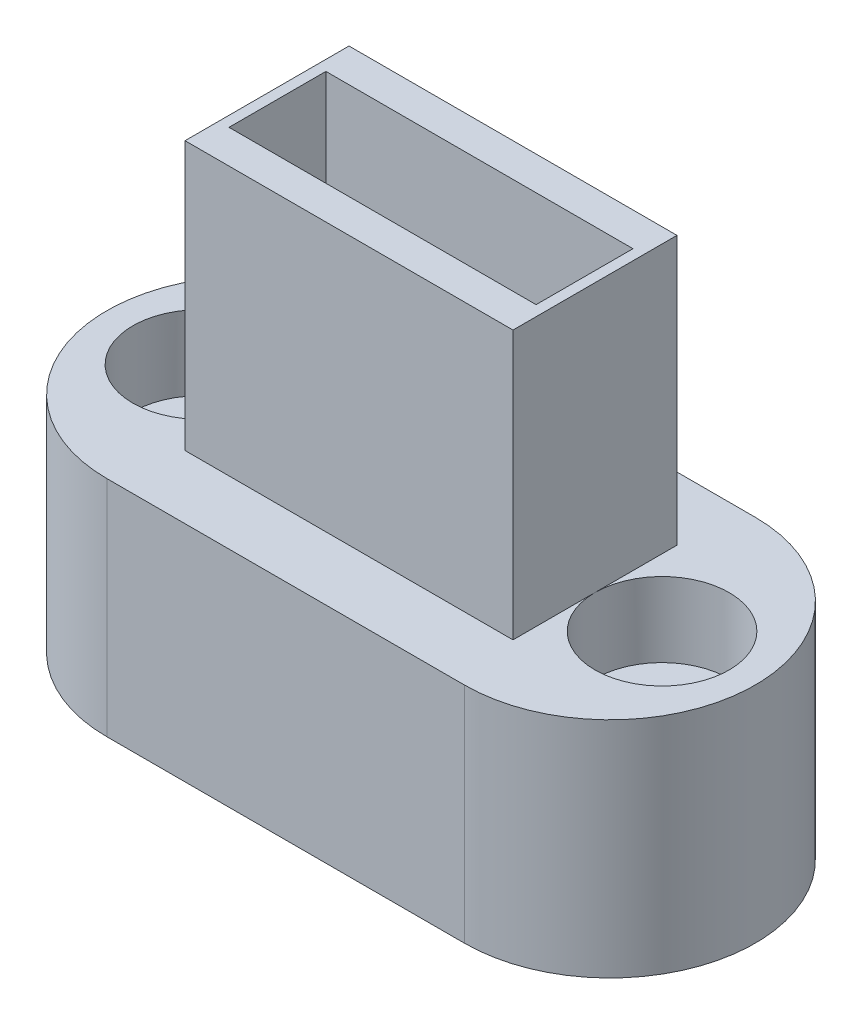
ISO-10303-21;
HEADER;
FILE_DESCRIPTION(('STEP AP214'),'2;1');
FILE_NAME('part.step','',(''),(''),'','','');
FILE_SCHEMA(('AUTOMOTIVE_DESIGN { 1 0 10303 214 1 1 1 1 }'));
ENDSEC;
DATA;
#1=APPLICATION_CONTEXT('core data for automotive mechanical design processes');
#2=APPLICATION_PROTOCOL_DEFINITION('international standard','automotive_design',2000,#1);
#3=PRODUCT_CONTEXT('',#1,'mechanical');
#4=PRODUCT('Part','Part','',(#3));
#5=PRODUCT_RELATED_PRODUCT_CATEGORY('part','',(#4));
#6=PRODUCT_DEFINITION_FORMATION('','',#4);
#7=PRODUCT_DEFINITION_CONTEXT('part definition',#1,'design');
#8=PRODUCT_DEFINITION('design','',#6,#7);
#9=PRODUCT_DEFINITION_SHAPE('','',#8);
#10=(LENGTH_UNIT() NAMED_UNIT(*) SI_UNIT(.MILLI.,.METRE.));
#11=(NAMED_UNIT(*) PLANE_ANGLE_UNIT() SI_UNIT($,.RADIAN.));
#12=(NAMED_UNIT(*) SI_UNIT($,.STERADIAN.) SOLID_ANGLE_UNIT());
#13=UNCERTAINTY_MEASURE_WITH_UNIT(LENGTH_MEASURE(1.E-05),#10,'distance_accuracy_value','');
#14=(GEOMETRIC_REPRESENTATION_CONTEXT(3) GLOBAL_UNCERTAINTY_ASSIGNED_CONTEXT((#13)) GLOBAL_UNIT_ASSIGNED_CONTEXT((#10,
#11,#12)) REPRESENTATION_CONTEXT('',''));
#15=CARTESIAN_POINT('',(0.,0.,0.));
#16=DIRECTION('',(0.,0.,1.));
#17=DIRECTION('',(1.,0.,0.));
#18=AXIS2_PLACEMENT_3D('',#15,#16,#17);
#19=CARTESIAN_POINT('',(-52.0537455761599,27.,3.25));
#20=DIRECTION('',(-1.,0.,0.));
#21=DIRECTION('',(0.,0.,1.));
#22=AXIS2_PLACEMENT_3D('',#19,#20,#21);
#23=PLANE('',#22);
#24=DIRECTION('',(0.,0.,-1.));
#25=VECTOR('',#24,1.);
#26=CARTESIAN_POINT('',(-52.0537455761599,26.,3.25));
#27=LINE('',#26,#25);
#28=CARTESIAN_POINT('',(-52.0537455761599,26.,1.5));
#29=VERTEX_POINT('',#28);
#30=CARTESIAN_POINT('',(-52.0537455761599,26.,-1.5));
#31=VERTEX_POINT('',#30);
#32=EDGE_CURVE('E201',#29,#31,#27,.T.);
#33=ORIENTED_EDGE('',*,*,#32,.F.);
#34=DIRECTION('',(0.,1.,0.));
#35=VECTOR('',#34,1.);
#36=CARTESIAN_POINT('',(-52.0537455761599,0.,1.5));
#37=LINE('',#36,#35);
#38=CARTESIAN_POINT('',(-52.0537455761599,0.,1.5));
#39=VERTEX_POINT('',#38);
#40=EDGE_CURVE('E251',#39,#29,#37,.T.);
#41=ORIENTED_EDGE('',*,*,#40,.F.);
#42=DIRECTION('',(0.,0.,1.));
#43=VECTOR('',#42,1.);
#44=CARTESIAN_POINT('',(-52.0537455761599,0.,-1.5));
#45=LINE('',#44,#43);
#46=CARTESIAN_POINT('',(-52.0537455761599,0.,-9.75));
#47=VERTEX_POINT('',#46);
#48=EDGE_CURVE('E241',#47,#39,#45,.T.);
#49=ORIENTED_EDGE('',*,*,#48,.F.);
#50=DIRECTION('',(0.,-1.,0.));
#51=VECTOR('',#50,1.);
#52=CARTESIAN_POINT('',(-52.0537455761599,3.,-9.75));
#53=LINE('',#52,#51);
#54=CARTESIAN_POINT('',(-52.0537455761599,3.,-9.75));
#55=VERTEX_POINT('',#54);
#56=EDGE_CURVE('E237',#55,#47,#53,.T.);
#57=ORIENTED_EDGE('',*,*,#56,.F.);
#58=DIRECTION('',(0.,0.,-1.));
#59=VECTOR('',#58,1.);
#60=CARTESIAN_POINT('',(-52.0537455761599,3.,-1.5));
#61=LINE('',#60,#59);
#62=CARTESIAN_POINT('',(-52.0537455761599,3.,-1.5));
#63=VERTEX_POINT('',#62);
#64=EDGE_CURVE('E231',#63,#55,#61,.T.);
#65=ORIENTED_EDGE('',*,*,#64,.F.);
#66=DIRECTION('',(0.,1.,0.));
#67=VECTOR('',#66,1.);
#68=CARTESIAN_POINT('',(-52.0537455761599,0.,-1.5));
#69=LINE('',#68,#67);
#70=EDGE_CURVE('E255',#63,#31,#69,.T.);
#71=ORIENTED_EDGE('',*,*,#70,.T.);
#72=EDGE_LOOP('',(#33,#41,#49,#57,#65,#71));
#73=FACE_BOUND('',#72,.T.);
#74=ADVANCED_FACE('F32',(#73),#23,.F.);
#75=CARTESIAN_POINT('',(-31.8537455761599,27.,3.25));
#76=DIRECTION('',(1.,0.,0.));
#77=DIRECTION('',(0.,0.,-1.));
#78=AXIS2_PLACEMENT_3D('',#75,#76,#77);
#79=PLANE('',#78);
#80=DIRECTION('',(0.,0.,1.));
#81=VECTOR('',#80,1.);
#82=CARTESIAN_POINT('',(-31.8537455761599,26.,3.25));
#83=LINE('',#82,#81);
#84=CARTESIAN_POINT('',(-31.8537455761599,26.,-1.5));
#85=VERTEX_POINT('',#84);
#86=CARTESIAN_POINT('',(-31.8537455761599,26.,1.5));
#87=VERTEX_POINT('',#86);
#88=EDGE_CURVE('E46',#85,#87,#83,.T.);
#89=ORIENTED_EDGE('',*,*,#88,.F.);
#90=DIRECTION('',(0.,1.,0.));
#91=VECTOR('',#90,1.);
#92=CARTESIAN_POINT('',(-31.8537455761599,0.,-1.5));
#93=LINE('',#92,#91);
#94=CARTESIAN_POINT('',(-31.8537455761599,3.,-1.5));
#95=VERTEX_POINT('',#94);
#96=EDGE_CURVE('E325',#95,#85,#93,.T.);
#97=ORIENTED_EDGE('',*,*,#96,.F.);
#98=DIRECTION('',(0.,0.,1.));
#99=VECTOR('',#98,1.);
#100=CARTESIAN_POINT('',(-31.8537455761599,3.,-1.5));
#101=LINE('',#100,#99);
#102=CARTESIAN_POINT('',(-31.8537455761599,3.,-9.75));
#103=VERTEX_POINT('',#102);
#104=EDGE_CURVE('E225',#103,#95,#101,.T.);
#105=ORIENTED_EDGE('',*,*,#104,.F.);
#106=DIRECTION('',(0.,-1.,0.));
#107=VECTOR('',#106,1.);
#108=CARTESIAN_POINT('',(-31.8537455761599,3.,-9.75));
#109=LINE('',#108,#107);
#110=CARTESIAN_POINT('',(-31.8537455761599,0.,-9.75));
#111=VERTEX_POINT('',#110);
#112=EDGE_CURVE('E238',#103,#111,#109,.T.);
#113=ORIENTED_EDGE('',*,*,#112,.T.);
#114=DIRECTION('',(0.,0.,-1.));
#115=VECTOR('',#114,1.);
#116=CARTESIAN_POINT('',(-31.8537455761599,0.,-1.5));
#117=LINE('',#116,#115);
#118=CARTESIAN_POINT('',(-31.8537455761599,0.,1.5));
#119=VERTEX_POINT('',#118);
#120=EDGE_CURVE('E249',#119,#111,#117,.T.);
#121=ORIENTED_EDGE('',*,*,#120,.F.);
#122=DIRECTION('',(0.,1.,0.));
#123=VECTOR('',#122,1.);
#124=CARTESIAN_POINT('',(-31.8537455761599,0.,1.5));
#125=LINE('',#124,#123);
#126=EDGE_CURVE('E328',#119,#87,#125,.T.);
#127=ORIENTED_EDGE('',*,*,#126,.T.);
#128=EDGE_LOOP('',(#89,#97,#105,#113,#121,#127));
#129=FACE_BOUND('',#128,.T.);
#130=ADVANCED_FACE('F350',(#129),#79,.F.);
#131=CARTESIAN_POINT('',(-52.0537455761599,0.,-1.5));
#132=DIRECTION('',(0.,0.,-1.));
#133=DIRECTION('',(-1.,0.,0.));
#134=AXIS2_PLACEMENT_3D('',#131,#132,#133);
#135=PLANE('',#134);
#136=DIRECTION('',(1.,0.,0.));
#137=VECTOR('',#136,1.);
#138=CARTESIAN_POINT('',(-52.0537455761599,26.,-1.5));
#139=LINE('',#138,#137);
#140=EDGE_CURVE('E203',#31,#85,#139,.T.);
#141=ORIENTED_EDGE('',*,*,#140,.F.);
#142=ORIENTED_EDGE('',*,*,#70,.F.);
#143=DIRECTION('',(-1.,0.,0.));
#144=VECTOR('',#143,1.);
#145=CARTESIAN_POINT('',(-31.8537455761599,3.,-1.5));
#146=LINE('',#145,#144);
#147=EDGE_CURVE('E228',#95,#63,#146,.T.);
#148=ORIENTED_EDGE('',*,*,#147,.F.);
#149=ORIENTED_EDGE('',*,*,#96,.T.);
#150=EDGE_LOOP('',(#141,#142,#148,#149));
#151=FACE_BOUND('',#150,.T.);
#152=ADVANCED_FACE('F346',(#151),#135,.F.);
#153=CARTESIAN_POINT('',(-52.0537455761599,0.,1.5));
#154=DIRECTION('',(0.,0.,1.));
#155=DIRECTION('',(1.,0.,0.));
#156=AXIS2_PLACEMENT_3D('',#153,#154,#155);
#157=PLANE('',#156);
#158=DIRECTION('',(-1.,0.,0.));
#159=VECTOR('',#158,1.);
#160=CARTESIAN_POINT('',(-52.0537455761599,26.,1.5));
#161=LINE('',#160,#159);
#162=EDGE_CURVE('E11',#87,#29,#161,.T.);
#163=ORIENTED_EDGE('',*,*,#162,.F.);
#164=ORIENTED_EDGE('',*,*,#126,.F.);
#165=DIRECTION('',(1.,0.,0.));
#166=VECTOR('',#165,1.);
#167=CARTESIAN_POINT('',(-52.0537455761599,0.,1.5));
#168=LINE('',#167,#166);
#169=EDGE_CURVE('E246',#39,#119,#168,.T.);
#170=ORIENTED_EDGE('',*,*,#169,.F.);
#171=ORIENTED_EDGE('',*,*,#40,.T.);
#172=EDGE_LOOP('',(#163,#164,#170,#171));
#173=FACE_BOUND('',#172,.T.);
#174=ADVANCED_FACE('F339',(#173),#157,.F.);
#175=CARTESIAN_POINT('',(-53.9537455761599,15.,0.));
#176=DIRECTION('',(0.,1.,0.));
#177=DIRECTION('',(0.,0.,1.));
#178=AXIS2_PLACEMENT_3D('',#175,#176,#177);
#179=PLANE('',#178);
#180=CARTESIAN_POINT('',(-53.9537455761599,15.,0.));
#181=DIRECTION('',(0.,1.,0.));
#182=DIRECTION('',(0.,0.,1.));
#183=AXIS2_PLACEMENT_3D('',#180,#181,#182);
#184=CIRCLE('',#183,9.75);
#185=CARTESIAN_POINT('',(-53.9537455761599,15.,-9.75));
#186=VERTEX_POINT('',#185);
#187=CARTESIAN_POINT('',(-53.9537455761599,15.,9.75));
#188=VERTEX_POINT('',#187);
#189=EDGE_CURVE('E291',#186,#188,#184,.T.);
#190=ORIENTED_EDGE('',*,*,#189,.T.);
#191=DIRECTION('',(1.,0.,0.));
#192=VECTOR('',#191,1.);
#193=CARTESIAN_POINT('',(-53.9537455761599,15.,9.75));
#194=LINE('',#193,#192);
#195=CARTESIAN_POINT('',(-29.9537455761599,15.,9.75));
#196=VERTEX_POINT('',#195);
#197=EDGE_CURVE('E294',#188,#196,#194,.T.);
#198=ORIENTED_EDGE('',*,*,#197,.T.);
#199=CARTESIAN_POINT('',(-29.9537455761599,15.,0.));
#200=DIRECTION('',(0.,1.,0.));
#201=DIRECTION('',(0.,0.,1.));
#202=AXIS2_PLACEMENT_3D('',#199,#200,#201);
#203=CIRCLE('',#202,9.75);
#204=CARTESIAN_POINT('',(-29.9537455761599,15.,-9.75));
#205=VERTEX_POINT('',#204);
#206=EDGE_CURVE('E297',#196,#205,#203,.T.);
#207=ORIENTED_EDGE('',*,*,#206,.T.);
#208=DIRECTION('',(-1.,0.,0.));
#209=VECTOR('',#208,1.);
#210=CARTESIAN_POINT('',(-53.9537455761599,15.,-9.75));
#211=LINE('',#210,#209);
#212=EDGE_CURVE('E299',#205,#186,#211,.T.);
#213=ORIENTED_EDGE('',*,*,#212,.T.);
#214=EDGE_LOOP('',(#190,#198,#207,#213));
#215=FACE_BOUND('',#214,.T.);
#216=DIRECTION('',(0.,0.,1.));
#217=VECTOR('',#216,1.);
#218=CARTESIAN_POINT('',(-52.9537455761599,15.,5.5));
#219=LINE('',#218,#217);
#220=CARTESIAN_POINT('',(-52.9537455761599,15.,0.));
#221=VERTEX_POINT('',#220);
#222=CARTESIAN_POINT('',(-52.9537455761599,15.,5.5));
#223=VERTEX_POINT('',#222);
#224=EDGE_CURVE('E257',#221,#223,#219,.T.);
#225=ORIENTED_EDGE('',*,*,#224,.F.);
#226=CARTESIAN_POINT('',(-57.4537455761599,15.,0.));
#227=DIRECTION('',(0.,1.,0.));
#228=DIRECTION('',(0.,0.,1.));
#229=AXIS2_PLACEMENT_3D('',#226,#227,#228);
#230=CIRCLE('',#229,4.5);
#231=EDGE_CURVE('E52',#221,#221,#230,.T.);
#232=ORIENTED_EDGE('',*,*,#231,.F.);
#233=CARTESIAN_POINT('',(-52.9537455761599,15.,-5.5));
#234=VERTEX_POINT('',#233);
#235=EDGE_CURVE('E269',#234,#221,#219,.T.);
#236=ORIENTED_EDGE('',*,*,#235,.F.);
#237=DIRECTION('',(-1.,0.,0.));
#238=VECTOR('',#237,1.);
#239=CARTESIAN_POINT('',(-52.9537455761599,15.,-5.5));
#240=LINE('',#239,#238);
#241=CARTESIAN_POINT('',(-30.9537455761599,15.,-5.5));
#242=VERTEX_POINT('',#241);
#243=EDGE_CURVE('E262',#242,#234,#240,.T.);
#244=ORIENTED_EDGE('',*,*,#243,.F.);
#245=DIRECTION('',(0.,0.,-1.));
#246=VECTOR('',#245,1.);
#247=CARTESIAN_POINT('',(-30.9537455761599,15.,5.5));
#248=LINE('',#247,#246);
#249=CARTESIAN_POINT('',(-30.9537455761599,15.,0.));
#250=VERTEX_POINT('',#249);
#251=EDGE_CURVE('E274',#250,#242,#248,.T.);
#252=ORIENTED_EDGE('',*,*,#251,.F.);
#253=CARTESIAN_POINT('',(-26.4537455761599,15.,0.));
#254=DIRECTION('',(0.,1.,0.));
#255=DIRECTION('',(0.,0.,1.));
#256=AXIS2_PLACEMENT_3D('',#253,#254,#255);
#257=CIRCLE('',#256,4.5);
#258=EDGE_CURVE('E220',#250,#250,#257,.T.);
#259=ORIENTED_EDGE('',*,*,#258,.F.);
#260=CARTESIAN_POINT('',(-30.9537455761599,15.,5.5));
#261=VERTEX_POINT('',#260);
#262=EDGE_CURVE('E275',#261,#250,#248,.T.);
#263=ORIENTED_EDGE('',*,*,#262,.F.);
#264=DIRECTION('',(1.,0.,0.));
#265=VECTOR('',#264,1.);
#266=CARTESIAN_POINT('',(-52.9537455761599,15.,5.5));
#267=LINE('',#266,#265);
#268=EDGE_CURVE('E272',#223,#261,#267,.T.);
#269=ORIENTED_EDGE('',*,*,#268,.F.);
#270=EDGE_LOOP('',(#225,#232,#236,#244,#252,#259,#263,#269));
#271=FACE_BOUND('',#270,.T.);
#272=ADVANCED_FACE('F365',(#215,#271),#179,.T.);
#273=CARTESIAN_POINT('',(-53.9537455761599,15.,0.));
#274=DIRECTION('',(0.,-1.,0.));
#275=DIRECTION('',(0.,0.,-1.));
#276=AXIS2_PLACEMENT_3D('',#273,#274,#275);
#277=CYLINDRICAL_SURFACE('',#276,9.75);
#278=CARTESIAN_POINT('',(-53.9537455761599,0.,0.));
#279=DIRECTION('',(0.,1.,0.));
#280=DIRECTION('',(0.,0.,1.));
#281=AXIS2_PLACEMENT_3D('',#278,#279,#280);
#282=CIRCLE('',#281,9.75);
#283=CARTESIAN_POINT('',(-53.9537455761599,0.,-9.75));
#284=VERTEX_POINT('',#283);
#285=CARTESIAN_POINT('',(-53.9537455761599,0.,9.75));
#286=VERTEX_POINT('',#285);
#287=EDGE_CURVE('E290',#284,#286,#282,.T.);
#288=ORIENTED_EDGE('',*,*,#287,.T.);
#289=DIRECTION('',(0.,-1.,0.));
#290=VECTOR('',#289,1.);
#291=CARTESIAN_POINT('',(-53.9537455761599,15.,9.75));
#292=LINE('',#291,#290);
#293=EDGE_CURVE('E40',#188,#286,#292,.T.);
#294=ORIENTED_EDGE('',*,*,#293,.F.);
#295=ORIENTED_EDGE('',*,*,#189,.F.);
#296=DIRECTION('',(0.,-1.,0.));
#297=VECTOR('',#296,1.);
#298=CARTESIAN_POINT('',(-53.9537455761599,15.,-9.75));
#299=LINE('',#298,#297);
#300=EDGE_CURVE('E301',#186,#284,#299,.T.);
#301=ORIENTED_EDGE('',*,*,#300,.T.);
#302=EDGE_LOOP('',(#288,#294,#295,#301));
#303=FACE_BOUND('',#302,.T.);
#304=ADVANCED_FACE('F34',(#303),#277,.T.);
#305=CARTESIAN_POINT('',(-53.9537455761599,15.,9.75));
#306=DIRECTION('',(0.,0.,-1.));
#307=DIRECTION('',(-1.,0.,0.));
#308=AXIS2_PLACEMENT_3D('',#305,#306,#307);
#309=PLANE('',#308);
#310=DIRECTION('',(1.,0.,0.));
#311=VECTOR('',#310,1.);
#312=CARTESIAN_POINT('',(-53.9537455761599,0.,9.75));
#313=LINE('',#312,#311);
#314=CARTESIAN_POINT('',(-29.9537455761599,0.,9.75));
#315=VERTEX_POINT('',#314);
#316=EDGE_CURVE('E304',#286,#315,#313,.T.);
#317=ORIENTED_EDGE('',*,*,#316,.T.);
#318=DIRECTION('',(0.,-1.,0.));
#319=VECTOR('',#318,1.);
#320=CARTESIAN_POINT('',(-29.9537455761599,15.,9.75));
#321=LINE('',#320,#319);
#322=EDGE_CURVE('E316',#196,#315,#321,.T.);
#323=ORIENTED_EDGE('',*,*,#322,.F.);
#324=ORIENTED_EDGE('',*,*,#197,.F.);
#325=ORIENTED_EDGE('',*,*,#293,.T.);
#326=EDGE_LOOP('',(#317,#323,#324,#325));
#327=FACE_BOUND('',#326,.T.);
#328=ADVANCED_FACE('F375',(#327),#309,.F.);
#329=CARTESIAN_POINT('',(-29.9537455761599,15.,0.));
#330=DIRECTION('',(0.,-1.,0.));
#331=DIRECTION('',(0.,0.,-1.));
#332=AXIS2_PLACEMENT_3D('',#329,#330,#331);
#333=CYLINDRICAL_SURFACE('',#332,9.75);
#334=CARTESIAN_POINT('',(-29.9537455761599,0.,0.));
#335=DIRECTION('',(0.,1.,0.));
#336=DIRECTION('',(0.,0.,1.));
#337=AXIS2_PLACEMENT_3D('',#334,#335,#336);
#338=CIRCLE('',#337,9.75);
#339=CARTESIAN_POINT('',(-29.9537455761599,0.,-9.75));
#340=VERTEX_POINT('',#339);
#341=EDGE_CURVE('E306',#315,#340,#338,.T.);
#342=ORIENTED_EDGE('',*,*,#341,.T.);
#343=DIRECTION('',(0.,-1.,0.));
#344=VECTOR('',#343,1.);
#345=CARTESIAN_POINT('',(-29.9537455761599,15.,-9.75));
#346=LINE('',#345,#344);
#347=EDGE_CURVE('E313',#205,#340,#346,.T.);
#348=ORIENTED_EDGE('',*,*,#347,.F.);
#349=ORIENTED_EDGE('',*,*,#206,.F.);
#350=ORIENTED_EDGE('',*,*,#322,.T.);
#351=EDGE_LOOP('',(#342,#348,#349,#350));
#352=FACE_BOUND('',#351,.T.);
#353=ADVANCED_FACE('F373',(#352),#333,.T.);
#354=CARTESIAN_POINT('',(-53.9537455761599,15.,-9.75));
#355=DIRECTION('',(0.,0.,1.));
#356=DIRECTION('',(1.,0.,0.));
#357=AXIS2_PLACEMENT_3D('',#354,#355,#356);
#358=PLANE('',#357);
#359=DIRECTION('',(-1.,0.,0.));
#360=VECTOR('',#359,1.);
#361=CARTESIAN_POINT('',(-53.9537455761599,0.,-9.75));
#362=LINE('',#361,#360);
#363=EDGE_CURVE('E295',#340,#111,#362,.T.);
#364=ORIENTED_EDGE('',*,*,#363,.T.);
#365=ORIENTED_EDGE('',*,*,#112,.F.);
#366=DIRECTION('',(1.,0.,0.));
#367=VECTOR('',#366,1.);
#368=CARTESIAN_POINT('',(-31.8537455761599,3.,-9.75));
#369=LINE('',#368,#367);
#370=EDGE_CURVE('E234',#55,#103,#369,.T.);
#371=ORIENTED_EDGE('',*,*,#370,.F.);
#372=ORIENTED_EDGE('',*,*,#56,.T.);
#373=EDGE_CURVE('E308',#47,#284,#362,.T.);
#374=ORIENTED_EDGE('',*,*,#373,.T.);
#375=ORIENTED_EDGE('',*,*,#300,.F.);
#376=ORIENTED_EDGE('',*,*,#212,.F.);
#377=ORIENTED_EDGE('',*,*,#347,.T.);
#378=EDGE_LOOP('',(#364,#365,#371,#372,#374,#375,#376,#377));
#379=FACE_BOUND('',#378,.T.);
#380=ADVANCED_FACE('F358',(#379),#358,.F.);
#381=CARTESIAN_POINT('',(-53.9537455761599,0.,0.));
#382=DIRECTION('',(0.,1.,0.));
#383=DIRECTION('',(0.,0.,1.));
#384=AXIS2_PLACEMENT_3D('',#381,#382,#383);
#385=PLANE('',#384);
#386=CARTESIAN_POINT('',(-57.4537455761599,0.,0.));
#387=DIRECTION('',(0.,1.,0.));
#388=DIRECTION('',(0.,0.,1.));
#389=AXIS2_PLACEMENT_3D('',#386,#387,#388);
#390=CIRCLE('',#389,2.25);
#391=CARTESIAN_POINT('',(-57.4537455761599,0.,2.25));
#392=VERTEX_POINT('',#391);
#393=EDGE_CURVE('E208',#392,#392,#390,.T.);
#394=ORIENTED_EDGE('',*,*,#393,.T.);
#395=EDGE_LOOP('',(#394));
#396=FACE_BOUND('',#395,.T.);
#397=CARTESIAN_POINT('',(-26.4537455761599,0.,0.));
#398=DIRECTION('',(0.,1.,0.));
#399=DIRECTION('',(0.,0.,1.));
#400=AXIS2_PLACEMENT_3D('',#397,#398,#399);
#401=CIRCLE('',#400,2.25);
#402=CARTESIAN_POINT('',(-26.4537455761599,0.,2.25));
#403=VERTEX_POINT('',#402);
#404=EDGE_CURVE('E214',#403,#403,#401,.T.);
#405=ORIENTED_EDGE('',*,*,#404,.T.);
#406=EDGE_LOOP('',(#405));
#407=FACE_BOUND('',#406,.T.);
#408=ORIENTED_EDGE('',*,*,#120,.T.);
#409=ORIENTED_EDGE('',*,*,#363,.F.);
#410=ORIENTED_EDGE('',*,*,#341,.F.);
#411=ORIENTED_EDGE('',*,*,#316,.F.);
#412=ORIENTED_EDGE('',*,*,#287,.F.);
#413=ORIENTED_EDGE('',*,*,#373,.F.);
#414=ORIENTED_EDGE('',*,*,#48,.T.);
#415=ORIENTED_EDGE('',*,*,#169,.T.);
#416=EDGE_LOOP('',(#408,#409,#410,#411,#412,#413,#414,#415));
#417=FACE_BOUND('',#416,.T.);
#418=ADVANCED_FACE('F352',(#396,#407,#417),#385,.F.);
#419=CARTESIAN_POINT('',(-52.9537455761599,33.,5.5));
#420=DIRECTION('',(1.,0.,0.));
#421=DIRECTION('',(0.,0.,-1.));
#422=AXIS2_PLACEMENT_3D('',#419,#420,#421);
#423=PLANE('',#422);
#424=ORIENTED_EDGE('',*,*,#235,.T.);
#425=ORIENTED_EDGE('',*,*,#224,.T.);
#426=DIRECTION('',(0.,-1.,0.));
#427=VECTOR('',#426,1.);
#428=CARTESIAN_POINT('',(-52.9537455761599,33.,5.5));
#429=LINE('',#428,#427);
#430=CARTESIAN_POINT('',(-52.9537455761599,33.,5.5));
#431=VERTEX_POINT('',#430);
#432=EDGE_CURVE('E287',#431,#223,#429,.T.);
#433=ORIENTED_EDGE('',*,*,#432,.F.);
#434=DIRECTION('',(0.,0.,1.));
#435=VECTOR('',#434,1.);
#436=CARTESIAN_POINT('',(-52.9537455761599,33.,5.5));
#437=LINE('',#436,#435);
#438=CARTESIAN_POINT('',(-52.9537455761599,33.,-5.5));
#439=VERTEX_POINT('',#438);
#440=EDGE_CURVE('E258',#439,#431,#437,.T.);
#441=ORIENTED_EDGE('',*,*,#440,.F.);
#442=DIRECTION('',(0.,-1.,0.));
#443=VECTOR('',#442,1.);
#444=CARTESIAN_POINT('',(-52.9537455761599,33.,-5.5));
#445=LINE('',#444,#443);
#446=EDGE_CURVE('E268',#439,#234,#445,.T.);
#447=ORIENTED_EDGE('',*,*,#446,.T.);
#448=EDGE_LOOP('',(#424,#425,#433,#441,#447));
#449=FACE_BOUND('',#448,.T.);
#450=ADVANCED_FACE('F407',(#449),#423,.F.);
#451=CARTESIAN_POINT('',(-52.9537455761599,33.,5.5));
#452=DIRECTION('',(0.,0.,-1.));
#453=DIRECTION('',(-1.,0.,0.));
#454=AXIS2_PLACEMENT_3D('',#451,#452,#453);
#455=PLANE('',#454);
#456=ORIENTED_EDGE('',*,*,#268,.T.);
#457=DIRECTION('',(0.,-1.,0.));
#458=VECTOR('',#457,1.);
#459=CARTESIAN_POINT('',(-30.9537455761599,33.,5.5));
#460=LINE('',#459,#458);
#461=CARTESIAN_POINT('',(-30.9537455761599,33.,5.5));
#462=VERTEX_POINT('',#461);
#463=EDGE_CURVE('E284',#462,#261,#460,.T.);
#464=ORIENTED_EDGE('',*,*,#463,.F.);
#465=DIRECTION('',(1.,0.,0.));
#466=VECTOR('',#465,1.);
#467=CARTESIAN_POINT('',(-52.9537455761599,33.,5.5));
#468=LINE('',#467,#466);
#469=EDGE_CURVE('E261',#431,#462,#468,.T.);
#470=ORIENTED_EDGE('',*,*,#469,.F.);
#471=ORIENTED_EDGE('',*,*,#432,.T.);
#472=EDGE_LOOP('',(#456,#464,#470,#471));
#473=FACE_BOUND('',#472,.T.);
#474=ADVANCED_FACE('F403',(#473),#455,.F.);
#475=CARTESIAN_POINT('',(-30.9537455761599,33.,5.5));
#476=DIRECTION('',(-1.,0.,0.));
#477=DIRECTION('',(0.,0.,1.));
#478=AXIS2_PLACEMENT_3D('',#475,#476,#477);
#479=PLANE('',#478);
#480=ORIENTED_EDGE('',*,*,#262,.T.);
#481=ORIENTED_EDGE('',*,*,#251,.T.);
#482=DIRECTION('',(0.,-1.,0.));
#483=VECTOR('',#482,1.);
#484=CARTESIAN_POINT('',(-30.9537455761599,33.,-5.5));
#485=LINE('',#484,#483);
#486=CARTESIAN_POINT('',(-30.9537455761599,33.,-5.5));
#487=VERTEX_POINT('',#486);
#488=EDGE_CURVE('E281',#487,#242,#485,.T.);
#489=ORIENTED_EDGE('',*,*,#488,.F.);
#490=DIRECTION('',(0.,0.,-1.));
#491=VECTOR('',#490,1.);
#492=CARTESIAN_POINT('',(-30.9537455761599,33.,5.5));
#493=LINE('',#492,#491);
#494=EDGE_CURVE('E264',#462,#487,#493,.T.);
#495=ORIENTED_EDGE('',*,*,#494,.F.);
#496=ORIENTED_EDGE('',*,*,#463,.T.);
#497=EDGE_LOOP('',(#480,#481,#489,#495,#496));
#498=FACE_BOUND('',#497,.T.);
#499=ADVANCED_FACE('F399',(#498),#479,.F.);
#500=CARTESIAN_POINT('',(-52.9537455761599,33.,-5.5));
#501=DIRECTION('',(0.,0.,1.));
#502=DIRECTION('',(1.,0.,0.));
#503=AXIS2_PLACEMENT_3D('',#500,#501,#502);
#504=PLANE('',#503);
#505=ORIENTED_EDGE('',*,*,#243,.T.);
#506=ORIENTED_EDGE('',*,*,#446,.F.);
#507=DIRECTION('',(-1.,0.,0.));
#508=VECTOR('',#507,1.);
#509=CARTESIAN_POINT('',(-52.9537455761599,33.,-5.5));
#510=LINE('',#509,#508);
#511=EDGE_CURVE('E266',#487,#439,#510,.T.);
#512=ORIENTED_EDGE('',*,*,#511,.F.);
#513=ORIENTED_EDGE('',*,*,#488,.T.);
#514=EDGE_LOOP('',(#505,#506,#512,#513));
#515=FACE_BOUND('',#514,.T.);
#516=ADVANCED_FACE('F395',(#515),#504,.F.);
#517=CARTESIAN_POINT('',(0.,33.,0.));
#518=DIRECTION('',(0.,-1.,0.));
#519=DIRECTION('',(0.,0.,-1.));
#520=AXIS2_PLACEMENT_3D('',#517,#518,#519);
#521=PLANE('',#520);
#522=DIRECTION('',(1.,0.,0.));
#523=VECTOR('',#522,1.);
#524=CARTESIAN_POINT('',(-52.0537455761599,33.,3.25));
#525=LINE('',#524,#523);
#526=CARTESIAN_POINT('',(-52.2537455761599,33.,3.25));
#527=VERTEX_POINT('',#526);
#528=CARTESIAN_POINT('',(-31.6537455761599,33.,3.25));
#529=VERTEX_POINT('',#528);
#530=EDGE_CURVE('E252',#527,#529,#525,.T.);
#531=ORIENTED_EDGE('',*,*,#530,.F.);
#532=DIRECTION('',(0.,0.,1.));
#533=VECTOR('',#532,1.);
#534=CARTESIAN_POINT('',(-52.2537455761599,33.,3.25));
#535=LINE('',#534,#533);
#536=CARTESIAN_POINT('',(-52.2537455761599,33.,-3.25));
#537=VERTEX_POINT('',#536);
#538=EDGE_CURVE('E186',#537,#527,#535,.T.);
#539=ORIENTED_EDGE('',*,*,#538,.F.);
#540=DIRECTION('',(-1.,0.,0.));
#541=VECTOR('',#540,1.);
#542=CARTESIAN_POINT('',(-52.0537455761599,33.,-3.25));
#543=LINE('',#542,#541);
#544=CARTESIAN_POINT('',(-31.6537455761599,33.,-3.25));
#545=VERTEX_POINT('',#544);
#546=EDGE_CURVE('E254',#545,#537,#543,.T.);
#547=ORIENTED_EDGE('',*,*,#546,.F.);
#548=DIRECTION('',(0.,0.,-1.));
#549=VECTOR('',#548,1.);
#550=CARTESIAN_POINT('',(-31.6537455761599,33.,3.25));
#551=LINE('',#550,#549);
#552=EDGE_CURVE('E170',#529,#545,#551,.T.);
#553=ORIENTED_EDGE('',*,*,#552,.F.);
#554=EDGE_LOOP('',(#531,#539,#547,#553));
#555=FACE_BOUND('',#554,.T.);
#556=ORIENTED_EDGE('',*,*,#440,.T.);
#557=ORIENTED_EDGE('',*,*,#469,.T.);
#558=ORIENTED_EDGE('',*,*,#494,.T.);
#559=ORIENTED_EDGE('',*,*,#511,.T.);
#560=EDGE_LOOP('',(#556,#557,#558,#559));
#561=FACE_BOUND('',#560,.T.);
#562=ADVANCED_FACE('F392',(#555,#561),#521,.F.);
#563=CARTESIAN_POINT('',(-52.0537455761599,27.,-3.25));
#564=DIRECTION('',(0.,0.,-1.));
#565=DIRECTION('',(-1.,0.,0.));
#566=AXIS2_PLACEMENT_3D('',#563,#564,#565);
#567=PLANE('',#566);
#568=ORIENTED_EDGE('',*,*,#546,.T.);
#569=DIRECTION('',(0.,1.,0.));
#570=VECTOR('',#569,1.);
#571=CARTESIAN_POINT('',(-52.2537455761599,26.,-3.25));
#572=LINE('',#571,#570);
#573=CARTESIAN_POINT('',(-52.2537455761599,26.,-3.25));
#574=VERTEX_POINT('',#573);
#575=EDGE_CURVE('E172',#574,#537,#572,.T.);
#576=ORIENTED_EDGE('',*,*,#575,.F.);
#577=DIRECTION('',(-1.,0.,0.));
#578=VECTOR('',#577,1.);
#579=CARTESIAN_POINT('',(-31.6537455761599,26.,-3.25));
#580=LINE('',#579,#578);
#581=CARTESIAN_POINT('',(-31.6537455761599,26.,-3.25));
#582=VERTEX_POINT('',#581);
#583=EDGE_CURVE('E176',#582,#574,#580,.T.);
#584=ORIENTED_EDGE('',*,*,#583,.F.);
#585=DIRECTION('',(0.,1.,0.));
#586=VECTOR('',#585,1.);
#587=CARTESIAN_POINT('',(-31.6537455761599,26.,-3.25));
#588=LINE('',#587,#586);
#589=EDGE_CURVE('E162',#582,#545,#588,.T.);
#590=ORIENTED_EDGE('',*,*,#589,.T.);
#591=EDGE_LOOP('',(#568,#576,#584,#590));
#592=FACE_BOUND('',#591,.T.);
#593=ADVANCED_FACE('F177',(#592),#567,.F.);
#594=CARTESIAN_POINT('',(-52.0537455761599,27.,3.25));
#595=DIRECTION('',(0.,0.,1.));
#596=DIRECTION('',(1.,0.,0.));
#597=AXIS2_PLACEMENT_3D('',#594,#595,#596);
#598=PLANE('',#597);
#599=DIRECTION('',(0.,1.,0.));
#600=VECTOR('',#599,1.);
#601=CARTESIAN_POINT('',(-52.2537455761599,26.,3.25));
#602=LINE('',#601,#600);
#603=CARTESIAN_POINT('',(-52.2537455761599,26.,3.25));
#604=VERTEX_POINT('',#603);
#605=EDGE_CURVE('E196',#604,#527,#602,.T.);
#606=ORIENTED_EDGE('',*,*,#605,.T.);
#607=ORIENTED_EDGE('',*,*,#530,.T.);
#608=DIRECTION('',(0.,1.,0.));
#609=VECTOR('',#608,1.);
#610=CARTESIAN_POINT('',(-31.6537455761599,26.,3.25));
#611=LINE('',#610,#609);
#612=CARTESIAN_POINT('',(-31.6537455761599,26.,3.25));
#613=VERTEX_POINT('',#612);
#614=EDGE_CURVE('E194',#613,#529,#611,.T.);
#615=ORIENTED_EDGE('',*,*,#614,.F.);
#616=DIRECTION('',(1.,0.,0.));
#617=VECTOR('',#616,1.);
#618=CARTESIAN_POINT('',(-31.6537455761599,26.,3.25));
#619=LINE('',#618,#617);
#620=EDGE_CURVE('E173',#604,#613,#619,.T.);
#621=ORIENTED_EDGE('',*,*,#620,.F.);
#622=EDGE_LOOP('',(#606,#607,#615,#621));
#623=FACE_BOUND('',#622,.T.);
#624=ADVANCED_FACE('F391',(#623),#598,.F.);
#625=CARTESIAN_POINT('',(0.,3.,0.));
#626=DIRECTION('',(0.,1.,0.));
#627=DIRECTION('',(0.,0.,1.));
#628=AXIS2_PLACEMENT_3D('',#625,#626,#627);
#629=PLANE('',#628);
#630=ORIENTED_EDGE('',*,*,#104,.T.);
#631=ORIENTED_EDGE('',*,*,#147,.T.);
#632=ORIENTED_EDGE('',*,*,#64,.T.);
#633=ORIENTED_EDGE('',*,*,#370,.T.);
#634=EDGE_LOOP('',(#630,#631,#632,#633));
#635=FACE_BOUND('',#634,.T.);
#636=ADVANCED_FACE('F460',(#635),#629,.F.);
#637=CARTESIAN_POINT('',(-26.4537455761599,10.,0.));
#638=DIRECTION('',(0.,1.,0.));
#639=DIRECTION('',(0.,0.,1.));
#640=AXIS2_PLACEMENT_3D('',#637,#638,#639);
#641=CYLINDRICAL_SURFACE('',#640,4.5);
#642=CARTESIAN_POINT('',(-26.4537455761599,10.,0.));
#643=DIRECTION('',(0.,1.,0.));
#644=DIRECTION('',(0.,0.,1.));
#645=AXIS2_PLACEMENT_3D('',#642,#643,#644);
#646=CIRCLE('',#645,4.5);
#647=CARTESIAN_POINT('',(-26.4537455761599,10.,4.5));
#648=VERTEX_POINT('',#647);
#649=EDGE_CURVE('E222',#648,#648,#646,.T.);
#650=ORIENTED_EDGE('',*,*,#649,.F.);
#651=EDGE_LOOP('',(#650));
#652=FACE_BOUND('',#651,.T.);
#653=ORIENTED_EDGE('',*,*,#258,.T.);
#654=EDGE_LOOP('',(#653));
#655=FACE_BOUND('',#654,.T.);
#656=ADVANCED_FACE('F463',(#652,#655),#641,.F.);
#657=CARTESIAN_POINT('',(-26.4537455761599,10.,0.));
#658=DIRECTION('',(0.,1.,0.));
#659=DIRECTION('',(0.,0.,1.));
#660=AXIS2_PLACEMENT_3D('',#657,#658,#659);
#661=PLANE('',#660);
#662=CARTESIAN_POINT('',(-26.4537455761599,10.,0.));
#663=DIRECTION('',(0.,1.,0.));
#664=DIRECTION('',(0.,0.,1.));
#665=AXIS2_PLACEMENT_3D('',#662,#663,#664);
#666=CIRCLE('',#665,2.25);
#667=CARTESIAN_POINT('',(-26.4537455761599,10.,2.25));
#668=VERTEX_POINT('',#667);
#669=EDGE_CURVE('E211',#668,#668,#666,.T.);
#670=ORIENTED_EDGE('',*,*,#669,.F.);
#671=EDGE_LOOP('',(#670));
#672=FACE_BOUND('',#671,.T.);
#673=ORIENTED_EDGE('',*,*,#649,.T.);
#674=EDGE_LOOP('',(#673));
#675=FACE_BOUND('',#674,.T.);
#676=ADVANCED_FACE('F470',(#672,#675),#661,.T.);
#677=CARTESIAN_POINT('',(-57.4537455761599,10.,0.));
#678=DIRECTION('',(0.,1.,0.));
#679=DIRECTION('',(0.,0.,1.));
#680=AXIS2_PLACEMENT_3D('',#677,#678,#679);
#681=CYLINDRICAL_SURFACE('',#680,4.5);
#682=CARTESIAN_POINT('',(-57.4537455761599,10.,0.));
#683=DIRECTION('',(0.,1.,0.));
#684=DIRECTION('',(0.,0.,1.));
#685=AXIS2_PLACEMENT_3D('',#682,#683,#684);
#686=CIRCLE('',#685,4.5);
#687=CARTESIAN_POINT('',(-57.4537455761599,10.,4.5));
#688=VERTEX_POINT('',#687);
#689=EDGE_CURVE('E217',#688,#688,#686,.T.);
#690=ORIENTED_EDGE('',*,*,#689,.F.);
#691=EDGE_LOOP('',(#690));
#692=FACE_BOUND('',#691,.T.);
#693=ORIENTED_EDGE('',*,*,#231,.T.);
#694=EDGE_LOOP('',(#693));
#695=FACE_BOUND('',#694,.T.);
#696=ADVANCED_FACE('F478',(#692,#695),#681,.F.);
#697=CARTESIAN_POINT('',(-57.4537455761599,10.,0.));
#698=DIRECTION('',(0.,1.,0.));
#699=DIRECTION('',(0.,0.,1.));
#700=AXIS2_PLACEMENT_3D('',#697,#698,#699);
#701=PLANE('',#700);
#702=CARTESIAN_POINT('',(-57.4537455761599,10.,0.));
#703=DIRECTION('',(0.,1.,0.));
#704=DIRECTION('',(0.,0.,1.));
#705=AXIS2_PLACEMENT_3D('',#702,#703,#704);
#706=CIRCLE('',#705,2.25);
#707=CARTESIAN_POINT('',(-57.4537455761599,10.,2.25));
#708=VERTEX_POINT('',#707);
#709=EDGE_CURVE('E205',#708,#708,#706,.T.);
#710=ORIENTED_EDGE('',*,*,#709,.F.);
#711=EDGE_LOOP('',(#710));
#712=FACE_BOUND('',#711,.T.);
#713=ORIENTED_EDGE('',*,*,#689,.T.);
#714=EDGE_LOOP('',(#713));
#715=FACE_BOUND('',#714,.T.);
#716=ADVANCED_FACE('F485',(#712,#715),#701,.T.);
#717=CARTESIAN_POINT('',(-26.4537455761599,-2.50000000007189E-05,0.));
#718=DIRECTION('',(0.,1.,0.));
#719=DIRECTION('',(0.,0.,1.));
#720=AXIS2_PLACEMENT_3D('',#717,#718,#719);
#721=CYLINDRICAL_SURFACE('',#720,2.25);
#722=ORIENTED_EDGE('',*,*,#669,.T.);
#723=EDGE_LOOP('',(#722));
#724=FACE_BOUND('',#723,.T.);
#725=ORIENTED_EDGE('',*,*,#404,.F.);
#726=EDGE_LOOP('',(#725));
#727=FACE_BOUND('',#726,.T.);
#728=ADVANCED_FACE('F492',(#724,#727),#721,.F.);
#729=CARTESIAN_POINT('',(-57.4537455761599,-2.50000000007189E-05,0.));
#730=DIRECTION('',(0.,1.,0.));
#731=DIRECTION('',(0.,0.,1.));
#732=AXIS2_PLACEMENT_3D('',#729,#730,#731);
#733=CYLINDRICAL_SURFACE('',#732,2.25);
#734=ORIENTED_EDGE('',*,*,#709,.T.);
#735=EDGE_LOOP('',(#734));
#736=FACE_BOUND('',#735,.T.);
#737=ORIENTED_EDGE('',*,*,#393,.F.);
#738=EDGE_LOOP('',(#737));
#739=FACE_BOUND('',#738,.T.);
#740=ADVANCED_FACE('F499',(#736,#739),#733,.F.);
#741=CARTESIAN_POINT('',(0.,26.,0.));
#742=DIRECTION('',(0.,1.,0.));
#743=DIRECTION('',(0.,0.,1.));
#744=AXIS2_PLACEMENT_3D('',#741,#742,#743);
#745=PLANE('',#744);
#746=DIRECTION('',(0.,0.,-1.));
#747=VECTOR('',#746,1.);
#748=CARTESIAN_POINT('',(-31.6537455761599,26.,3.25));
#749=LINE('',#748,#747);
#750=EDGE_CURVE('E167',#613,#582,#749,.T.);
#751=ORIENTED_EDGE('',*,*,#750,.T.);
#752=ORIENTED_EDGE('',*,*,#583,.T.);
#753=DIRECTION('',(0.,0.,1.));
#754=VECTOR('',#753,1.);
#755=CARTESIAN_POINT('',(-52.2537455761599,26.,3.25));
#756=LINE('',#755,#754);
#757=EDGE_CURVE('E182',#574,#604,#756,.T.);
#758=ORIENTED_EDGE('',*,*,#757,.T.);
#759=ORIENTED_EDGE('',*,*,#620,.T.);
#760=EDGE_LOOP('',(#751,#752,#758,#759));
#761=FACE_BOUND('',#760,.T.);
#762=ORIENTED_EDGE('',*,*,#140,.T.);
#763=ORIENTED_EDGE('',*,*,#88,.T.);
#764=ORIENTED_EDGE('',*,*,#162,.T.);
#765=ORIENTED_EDGE('',*,*,#32,.T.);
#766=EDGE_LOOP('',(#762,#763,#764,#765));
#767=FACE_BOUND('',#766,.T.);
#768=ADVANCED_FACE('F184',(#761,#767),#745,.T.);
#769=CARTESIAN_POINT('',(-31.6537455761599,26.,3.25));
#770=DIRECTION('',(1.,0.,0.));
#771=DIRECTION('',(0.,0.,-1.));
#772=AXIS2_PLACEMENT_3D('',#769,#770,#771);
#773=PLANE('',#772);
#774=ORIENTED_EDGE('',*,*,#552,.T.);
#775=ORIENTED_EDGE('',*,*,#589,.F.);
#776=ORIENTED_EDGE('',*,*,#750,.F.);
#777=ORIENTED_EDGE('',*,*,#614,.T.);
#778=EDGE_LOOP('',(#774,#775,#776,#777));
#779=FACE_BOUND('',#778,.T.);
#780=ADVANCED_FACE('F164',(#779),#773,.F.);
#781=CARTESIAN_POINT('',(-52.2537455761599,26.,3.25));
#782=DIRECTION('',(-1.,0.,0.));
#783=DIRECTION('',(0.,0.,1.));
#784=AXIS2_PLACEMENT_3D('',#781,#782,#783);
#785=PLANE('',#784);
#786=ORIENTED_EDGE('',*,*,#538,.T.);
#787=ORIENTED_EDGE('',*,*,#605,.F.);
#788=ORIENTED_EDGE('',*,*,#757,.F.);
#789=ORIENTED_EDGE('',*,*,#575,.T.);
#790=EDGE_LOOP('',(#786,#787,#788,#789));
#791=FACE_BOUND('',#790,.T.);
#792=ADVANCED_FACE('F556',(#791),#785,.F.);
#793=CLOSED_SHELL('',(#74,#130,#152,#174,#272,#304,#328,#353,#380,#418,#450,#474,#499,#516,#562,
#593,#624,#636,#656,#676,#696,#716,#728,#740,#768,#780,#792));
#794=MANIFOLD_SOLID_BREP('B2',#793);
#795=ADVANCED_BREP_SHAPE_REPRESENTATION('',(#18,#794),#14);
#796=SHAPE_DEFINITION_REPRESENTATION(#9,#795);
ENDSEC;
END-ISO-10303-21;
